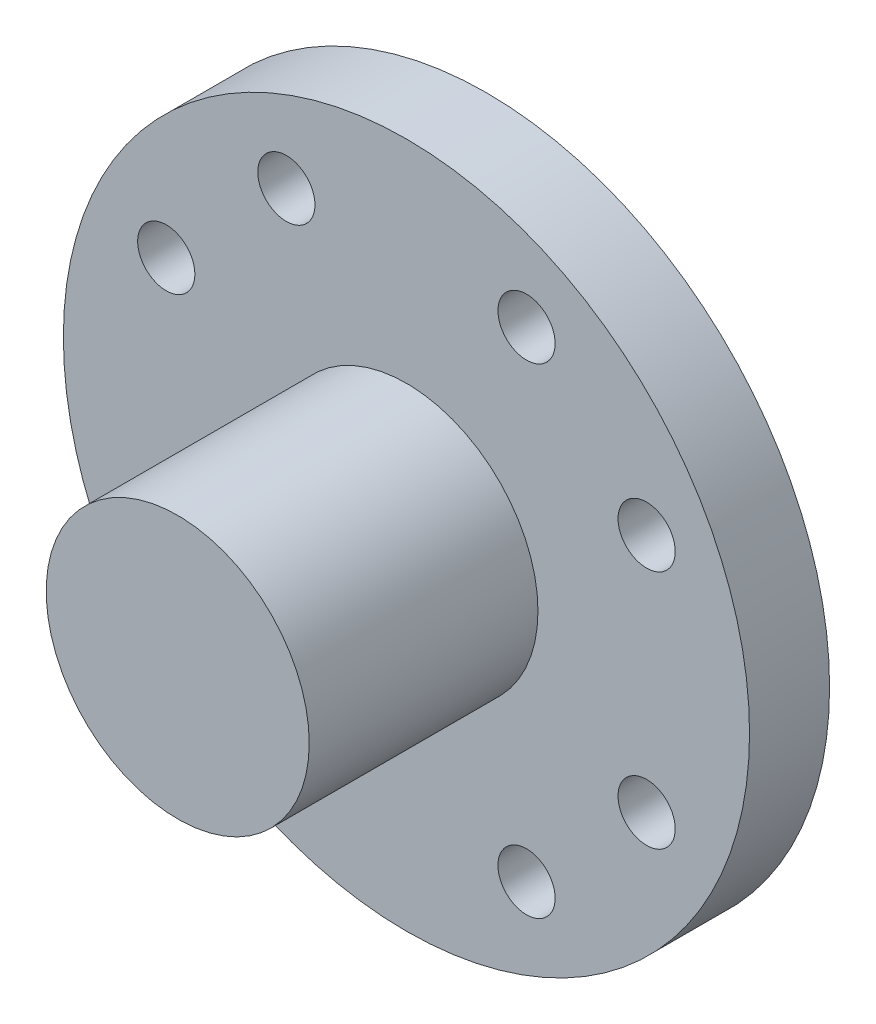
from build123d import *

# Parameters (mm, degrees)
BASE_SKETCH_R                 = 38.1
BOSS_EXTRUDE_BASE_DEPTH       = 8.89
SPROKET_ATTACHMENT_SKETCH_R   = 14.605
BOSS_EXTRUDE_ATTACHMENT_DEPTH = 25.4
HOLES_SKETCH_R                = 3.175
CUT_EXTRUDE_HOLES_DEPTH       = 60.56828015


with BuildPart() as part:
    # Base Sketch → Boss-Extrude Base (new body)
    with BuildSketch(Plane.XY):
        Circle(BASE_SKETCH_R)
    extrude(amount=BOSS_EXTRUDE_BASE_DEPTH)

    # Sproket Attachment Sketch → Boss-Extrude Attachment (add)
    with BuildSketch(Plane.XY.offset(8.89)):
        Circle(SPROKET_ATTACHMENT_SKETCH_R)
    extrude(amount=BOSS_EXTRUDE_ATTACHMENT_DEPTH)

    # Holes Sketch → Cut-Extrude Holes (cut, through all)
    with BuildSketch(Plane.XY.offset(8.89)):
        with Locations((-13.335, 26.67)):
            Circle(HOLES_SKETCH_R)
        with Locations((13.335, 26.67)):
            Circle(HOLES_SKETCH_R)
        with Locations((26.67, 13.335)):
            Circle(HOLES_SKETCH_R)
        with Locations((26.67, -13.335)):
            Circle(HOLES_SKETCH_R)
        with Locations((13.335, -26.67)):
            Circle(HOLES_SKETCH_R)
        with Locations((-13.335, -26.67)):
            Circle(HOLES_SKETCH_R)
        with Locations((-26.67, -13.335)):
            Circle(HOLES_SKETCH_R)
        with Locations((-26.67, 13.335)):
            Circle(HOLES_SKETCH_R)
    extrude(amount=-CUT_EXTRUDE_HOLES_DEPTH, mode=Mode.SUBTRACT)


solid = part.part
